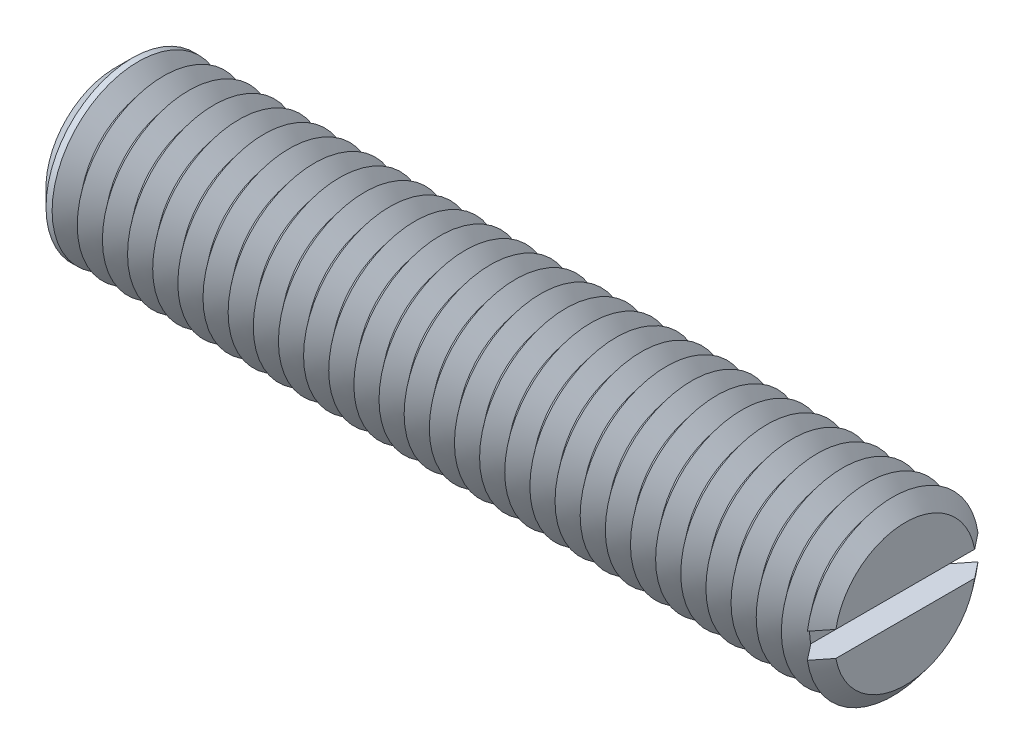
from build123d import *

# Parameters (mm, degrees)
SKETCH1_R       = 6
EXTRUDE1_DEPTH  = 27.5
SKETCH2_W       = 1.75
SKETCH2_H       = 1.75
EXTRUDE2_DEPTH  = 9
CHAMFER1_SIZE   = 1.2
LPATTERN1_COUNT = 31
LPATTERN1_PITCH = 1.75


with BuildPart() as part:
    # Sketch1 → Extrude1 (new, symmetric)
    with BuildSketch(Plane(origin=(0, 0, 0), x_dir=(0, 0, -1), z_dir=(1, 0, 0))):
        Circle(SKETCH1_R)
    extrude(amount=EXTRUDE1_DEPTH, both=True)

    # Sketch2 → Extrude2 (cut, symmetric)
    with BuildSketch(Plane.XY):
        with Locations((26.625, 0)):
            Rectangle(SKETCH2_W, SKETCH2_H)
    extrude(amount=EXTRUDE2_DEPTH, both=True, mode=Mode.SUBTRACT)

    # Chamfer1
    chamfer1_edges = [part.edges().sort_by_distance(p)[0] for p in [
        (-27.5, 0, 6),
    ]]
    chamfer(chamfer1_edges, length=CHAMFER1_SIZE)

    # Sketch3 → Cut-Revolve1 (revolve, cut)
    with BuildSketch(Plane.XY, mode=Mode.PRIVATE) as cut_revolve1_sk:
        Polygon((26.625, -6), (28.375, -6), (27.5, -4.90712535), align=None)
    cut_revolve1 = revolve(cut_revolve1_sk.sketch.rotate(Axis((0, 0, 0), (1, 0, 0)), 261.614461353), axis=Axis((0, 0, 0), (1, 0, 0)), mode=Mode.SUBTRACT)

    # LPattern1: Cut-Revolve1 ×31
    with Locations(*[(-i * LPATTERN1_PITCH, 0, 0) for i in range(1, LPATTERN1_COUNT)]):
        add(cut_revolve1, mode=Mode.SUBTRACT)


solid = part.part
